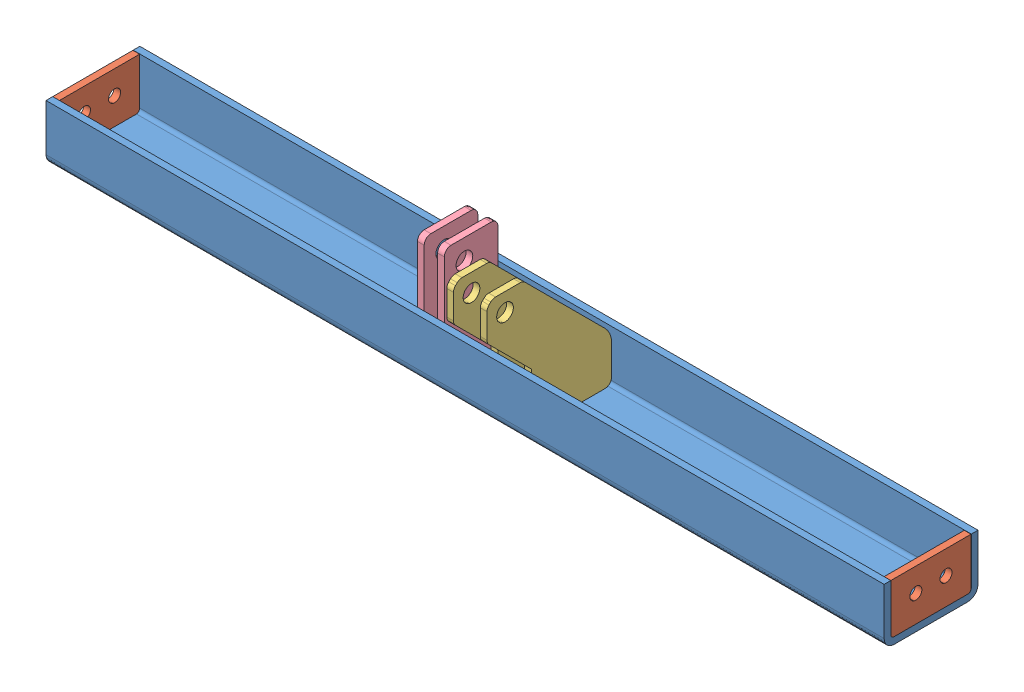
SolidWorks assembly ELEMENT DE TETE ASM.sldasm, configuration Défaut (file format 7000). Lengths in mm.
Overall size (625 138.28 138.28).
7 component instances, 4 part files, 18 mates.
Components (placement in the parent):
- TOLE SUPERIEUR-1: TOLE SUPERIEUR.SLDPRT [Défaut] at (22.3505 8.9073 -24.7144) x (1 0 0) z (0 1 0) size (625 70 42.5)
- EXTREMITE ELT DE TETE-1: EXTREMITE ELT DE TETE.SLDPRT [Défaut] at (332.3505 8.9073 -24.6144) x (0 0 1) z (0 -1 0) size (59.8 5 37.5)
- EXTREMITE ELT DE TETE-2: EXTREMITE ELT DE TETE.SLDPRT [Défaut] at (-287.6495 8.9073 -24.6144) x (0 0 -1) z (0 -1 0) size (59.8 5 37.5)
- PLAT ATTACHE POULIE-3: PLAT ATTACHE POULIE.SLDPRT [Défaut] at (64.3505 57.9723 24.9805) x (0 -0.707107 -0.707107) z (0 -0.707107 0.707107) size (131.35 5 64.21)
- PLAT ATTACHE POULIE-2: PLAT ATTACHE POULIE.SLDPRT [Défaut] at (39.3505 57.9723 24.9805) x (0 -0.707107 -0.707107) z (0 -0.707107 0.707107) size (131.35 5 64.21)
- PLAT ACCROCHE CABLE-3: PLAT ACCROCHE CABLE.SLDPRT [Défaut] at (-0.6495 13.9073 -14.7144) x (0 -1 0) z (0 0 1) size (85 5 40)
- PLAT ACCROCHE CABLE-2: PLAT ACCROCHE CABLE.SLDPRT [Défaut] at (-15.6495 13.9073 -14.7144) x (0 -1 0) z (0 0 1) size (85 5 40)
Mates (geometry in assembly coordinates):
- Coïncidente1: coincident anti-aligned: plane of TOLE SUPERIEUR-1 through (-290.1495 -28.5927 -52.2144) normal (0 1 0); plane of EXTREMITE ELT DE TETE-2 through (-290.1495 -28.5927 2.7856) normal (0 -1 0)
- Coïncidente2: coincident anti-aligned: plane of TOLE SUPERIEUR-1 through (-290.1495 -26.0927 5.2856) normal (0 0 -1); plane of EXTREMITE ELT DE TETE-2 through (-290.1495 8.9073 5.2856) normal (0 0 1)
- Coïncidente3: coincident aligned: plane of TOLE SUPERIEUR-1 through (-290.1495 -26.0927 -52.2144) normal (-1 0 0); plane of EXTREMITE ELT DE TETE-2 through (-290.1495 -26.0927 2.7856) normal (-1 0 0)
- Coïncidente4: coincident anti-aligned: plane of TOLE SUPERIEUR-1 through (-290.1495 -28.5927 -52.2144) normal (0 1 0); plane of EXTREMITE ELT DE TETE-1 through (334.8505 -28.5927 -52.0144) normal (0 -1 0)
- Coïncidente5: coincident anti-aligned: plane of TOLE SUPERIEUR-1 through (-290.1495 -26.0927 5.2856) normal (0 0 -1); plane of EXTREMITE ELT DE TETE-1 through (334.8505 -26.0927 5.2856) normal (0 0 1)
- Coïncidente6: coincident aligned: plane of TOLE SUPERIEUR-1 through (334.8505 -26.0927 -52.2144) normal (1 0 0); plane of EXTREMITE ELT DE TETE-1 through (334.8505 -26.0927 -52.0144) normal (1 0 0)
- Coïncidente7: coincident anti-aligned: plane of TOLE SUPERIEUR-1 through (-290.1495 -28.5927 -52.2144) normal (0 1 0); plane of PLAT ATTACHE POULIE-3 through (61.8505 -28.5927 0.2856) normal (0 -1 0)
- Coïncidente8: coincident anti-aligned: plane of TOLE SUPERIEUR-1 through (-290.1495 -26.0927 5.2856) normal (0 0 -1); plane of PLAT ATTACHE POULIE-3 through (61.8505 11.4073 5.2856) normal (0 0 1)
- Distance1: distance = 263 mm anti-aligned: plane of EXTREMITE ELT DE TETE-1 through (329.8505 -26.0927 -52.0144) normal (-1 0 0); plane of PLAT ATTACHE POULIE-3 through (66.8505 65.0936 33.4155) normal (1 0 0)
- Coïncidente10: coincident anti-aligned: plane of TOLE SUPERIEUR-1 through (-290.1495 -28.5927 -52.2144) normal (0 1 0); plane of PLAT ATTACHE POULIE-2 through (36.8505 -28.5927 0.2856) normal (0 -1 0)
- Coïncidente11: coincident anti-aligned: plane of TOLE SUPERIEUR-1 through (-290.1495 -26.0927 5.2856) normal (0 0 -1); plane of PLAT ATTACHE POULIE-2 through (36.8505 11.4073 5.2856) normal (0 0 1)
- Distance2: distance = 20 mm anti-aligned: plane of PLAT ATTACHE POULIE-3 through (61.8505 65.0936 33.4155) normal (-1 0 0); plane of PLAT ATTACHE POULIE-2 through (41.8505 65.0936 33.4155) normal (1 0 0)
- Coïncidente13: coincident anti-aligned: plane of TOLE SUPERIEUR-1 through (-290.1495 -28.5927 -52.2144) normal (0 1 0); plane of PLAT ACCROCHE CABLE-2 through (-18.1495 -28.5927 0.2856) normal (0 -1 0)
- Coïncidente14: coincident anti-aligned: plane of TOLE SUPERIEUR-1 through (-290.1495 -26.0927 5.2856) normal (0 0 -1); plane of PLAT ACCROCHE CABLE-2 through (-18.1495 51.4073 5.2856) normal (0 0 1)
- Coïncidente16: coincident anti-aligned: plane of TOLE SUPERIEUR-1 through (-290.1495 -28.5927 -52.2144) normal (0 1 0); plane of PLAT ACCROCHE CABLE-3 through (-3.1495 -28.5927 0.2856) normal (0 -1 0)
- Coïncidente17: coincident anti-aligned: plane of TOLE SUPERIEUR-1 through (-290.1495 -26.0927 5.2856) normal (0 0 -1); plane of PLAT ACCROCHE CABLE-3 through (-3.1495 51.4073 5.2856) normal (0 0 1)
- Distance4: distance = 10 mm anti-aligned: plane of PLAT ACCROCHE CABLE-3 through (-3.1495 51.4073 0.2856) normal (-1 0 0); plane of PLAT ACCROCHE CABLE-2 through (-13.1495 51.4073 0.2856) normal (1 0 0)
- Distance5: distance = 35 mm anti-aligned: plane of PLAT ACCROCHE CABLE-3 through (1.8505 51.4073 0.2856) normal (1 0 0); plane of PLAT ATTACHE POULIE-2 through (36.8505 65.0936 33.4155) normal (-1 0 0)
